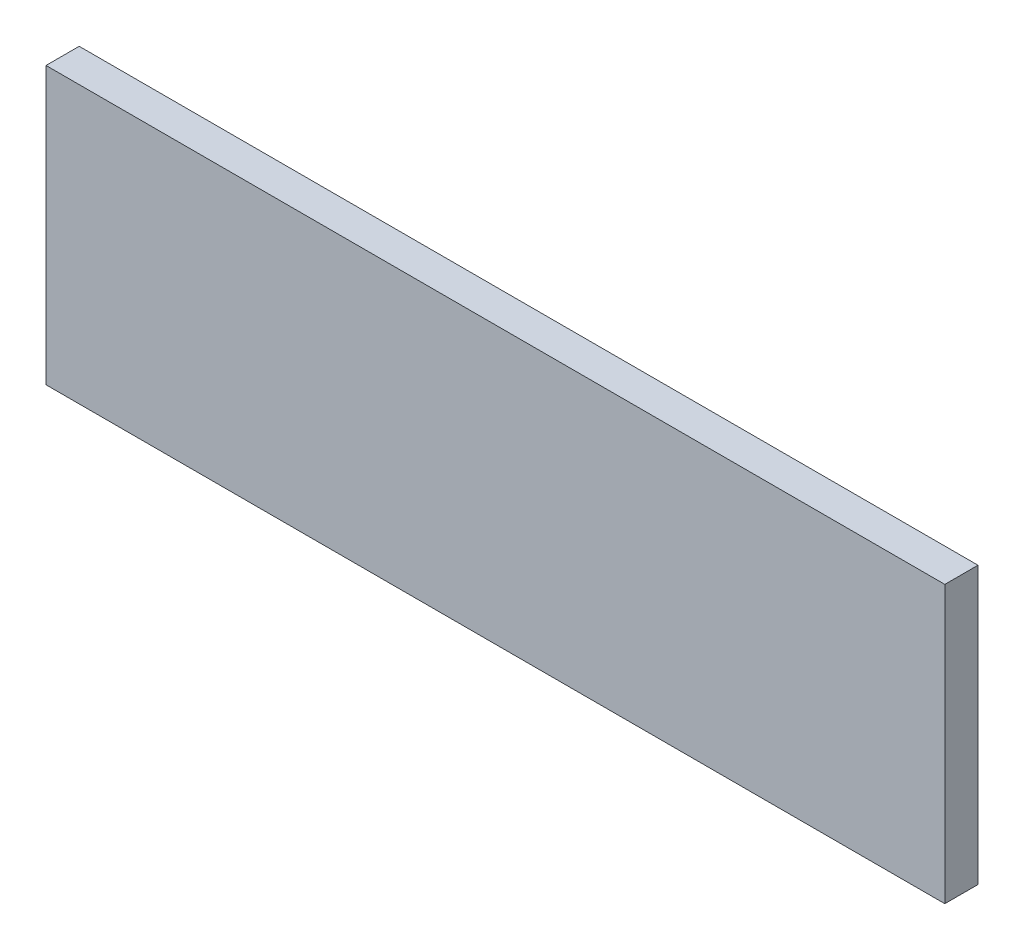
ISO-10303-21;
HEADER;
FILE_DESCRIPTION(('STEP AP214'),'2;1');
FILE_NAME('part.step','',(''),(''),'','','');
FILE_SCHEMA(('AUTOMOTIVE_DESIGN { 1 0 10303 214 1 1 1 1 }'));
ENDSEC;
DATA;
#1=APPLICATION_CONTEXT('core data for automotive mechanical design processes');
#2=APPLICATION_PROTOCOL_DEFINITION('international standard','automotive_design',2000,#1);
#3=PRODUCT_CONTEXT('',#1,'mechanical');
#4=PRODUCT('Part','Part','',(#3));
#5=PRODUCT_RELATED_PRODUCT_CATEGORY('part','',(#4));
#6=PRODUCT_DEFINITION_FORMATION('','',#4);
#7=PRODUCT_DEFINITION_CONTEXT('part definition',#1,'design');
#8=PRODUCT_DEFINITION('design','',#6,#7);
#9=PRODUCT_DEFINITION_SHAPE('','',#8);
#10=(LENGTH_UNIT() NAMED_UNIT(*) SI_UNIT(.MILLI.,.METRE.));
#11=(NAMED_UNIT(*) PLANE_ANGLE_UNIT() SI_UNIT($,.RADIAN.));
#12=(NAMED_UNIT(*) SI_UNIT($,.STERADIAN.) SOLID_ANGLE_UNIT());
#13=UNCERTAINTY_MEASURE_WITH_UNIT(LENGTH_MEASURE(1.E-05),#10,'distance_accuracy_value','');
#14=(GEOMETRIC_REPRESENTATION_CONTEXT(3) GLOBAL_UNCERTAINTY_ASSIGNED_CONTEXT((#13)) GLOBAL_UNIT_ASSIGNED_CONTEXT((#10,
#11,#12)) REPRESENTATION_CONTEXT('',''));
#15=CARTESIAN_POINT('',(0.,0.,0.));
#16=DIRECTION('',(0.,0.,1.));
#17=DIRECTION('',(1.,0.,0.));
#18=AXIS2_PLACEMENT_3D('',#15,#16,#17);
#19=CARTESIAN_POINT('',(0.,0.,12.));
#20=DIRECTION('',(1.,0.,0.));
#21=DIRECTION('',(0.,1.,0.));
#22=AXIS2_PLACEMENT_3D('',#19,#20,#21);
#23=PLANE('',#22);
#24=DIRECTION('',(0.,-1.,0.));
#25=VECTOR('',#24,1.);
#26=CARTESIAN_POINT('',(0.,0.,0.));
#27=LINE('',#26,#25);
#28=CARTESIAN_POINT('',(0.,0.,0.));
#29=VERTEX_POINT('',#28);
#30=CARTESIAN_POINT('',(0.,-100.,0.));
#31=VERTEX_POINT('',#30);
#32=EDGE_CURVE('E75',#29,#31,#27,.T.);
#33=ORIENTED_EDGE('',*,*,#32,.T.);
#34=DIRECTION('',(0.,0.,-1.));
#35=VECTOR('',#34,1.);
#36=CARTESIAN_POINT('',(0.,-100.,12.));
#37=LINE('',#36,#35);
#38=CARTESIAN_POINT('',(0.,-100.,12.));
#39=VERTEX_POINT('',#38);
#40=EDGE_CURVE('E11',#39,#31,#37,.T.);
#41=ORIENTED_EDGE('',*,*,#40,.F.);
#42=DIRECTION('',(0.,-1.,0.));
#43=VECTOR('',#42,1.);
#44=CARTESIAN_POINT('',(0.,0.,12.));
#45=LINE('',#44,#43);
#46=CARTESIAN_POINT('',(0.,0.,12.));
#47=VERTEX_POINT('',#46);
#48=EDGE_CURVE('E93',#47,#39,#45,.T.);
#49=ORIENTED_EDGE('',*,*,#48,.F.);
#50=DIRECTION('',(0.,0.,-1.));
#51=VECTOR('',#50,1.);
#52=CARTESIAN_POINT('',(0.,0.,12.));
#53=LINE('',#52,#51);
#54=EDGE_CURVE('E87',#47,#29,#53,.T.);
#55=ORIENTED_EDGE('',*,*,#54,.T.);
#56=EDGE_LOOP('',(#33,#41,#49,#55));
#57=FACE_BOUND('',#56,.T.);
#58=ADVANCED_FACE('F31',(#57),#23,.F.);
#59=CARTESIAN_POINT('',(0.,-100.,12.));
#60=DIRECTION('',(0.,1.,0.));
#61=DIRECTION('',(0.,0.,1.));
#62=AXIS2_PLACEMENT_3D('',#59,#60,#61);
#63=PLANE('',#62);
#64=DIRECTION('',(1.,0.,0.));
#65=VECTOR('',#64,1.);
#66=CARTESIAN_POINT('',(0.,-100.,0.));
#67=LINE('',#66,#65);
#68=CARTESIAN_POINT('',(325.,-100.,0.));
#69=VERTEX_POINT('',#68);
#70=EDGE_CURVE('E71',#31,#69,#67,.T.);
#71=ORIENTED_EDGE('',*,*,#70,.T.);
#72=DIRECTION('',(0.,0.,-1.));
#73=VECTOR('',#72,1.);
#74=CARTESIAN_POINT('',(325.,-100.,12.));
#75=LINE('',#74,#73);
#76=CARTESIAN_POINT('',(325.,-100.,12.));
#77=VERTEX_POINT('',#76);
#78=EDGE_CURVE('E38',#77,#69,#75,.T.);
#79=ORIENTED_EDGE('',*,*,#78,.F.);
#80=DIRECTION('',(1.,0.,0.));
#81=VECTOR('',#80,1.);
#82=CARTESIAN_POINT('',(0.,-100.,12.));
#83=LINE('',#82,#81);
#84=EDGE_CURVE('E83',#39,#77,#83,.T.);
#85=ORIENTED_EDGE('',*,*,#84,.F.);
#86=ORIENTED_EDGE('',*,*,#40,.T.);
#87=EDGE_LOOP('',(#71,#79,#85,#86));
#88=FACE_BOUND('',#87,.T.);
#89=ADVANCED_FACE('F82',(#88),#63,.F.);
#90=CARTESIAN_POINT('',(325.,0.,12.));
#91=DIRECTION('',(-1.,0.,0.));
#92=DIRECTION('',(0.,0.,1.));
#93=AXIS2_PLACEMENT_3D('',#90,#91,#92);
#94=PLANE('',#93);
#95=DIRECTION('',(0.,1.,0.));
#96=VECTOR('',#95,1.);
#97=CARTESIAN_POINT('',(325.,0.,0.));
#98=LINE('',#97,#96);
#99=CARTESIAN_POINT('',(325.,0.,0.));
#100=VERTEX_POINT('',#99);
#101=EDGE_CURVE('E76',#69,#100,#98,.T.);
#102=ORIENTED_EDGE('',*,*,#101,.T.);
#103=DIRECTION('',(0.,0.,-1.));
#104=VECTOR('',#103,1.);
#105=CARTESIAN_POINT('',(325.,0.,12.));
#106=LINE('',#105,#104);
#107=CARTESIAN_POINT('',(325.,0.,12.));
#108=VERTEX_POINT('',#107);
#109=EDGE_CURVE('E99',#108,#100,#106,.T.);
#110=ORIENTED_EDGE('',*,*,#109,.F.);
#111=DIRECTION('',(0.,1.,0.));
#112=VECTOR('',#111,1.);
#113=CARTESIAN_POINT('',(325.,0.,12.));
#114=LINE('',#113,#112);
#115=EDGE_CURVE('E50',#77,#108,#114,.T.);
#116=ORIENTED_EDGE('',*,*,#115,.F.);
#117=ORIENTED_EDGE('',*,*,#78,.T.);
#118=EDGE_LOOP('',(#102,#110,#116,#117));
#119=FACE_BOUND('',#118,.T.);
#120=ADVANCED_FACE('F102',(#119),#94,.F.);
#121=CARTESIAN_POINT('',(0.,0.,12.));
#122=DIRECTION('',(0.,-1.,0.));
#123=DIRECTION('',(0.,0.,-1.));
#124=AXIS2_PLACEMENT_3D('',#121,#122,#123);
#125=PLANE('',#124);
#126=DIRECTION('',(-1.,0.,0.));
#127=VECTOR('',#126,1.);
#128=CARTESIAN_POINT('',(0.,0.,0.));
#129=LINE('',#128,#127);
#130=EDGE_CURVE('E91',#100,#29,#129,.T.);
#131=ORIENTED_EDGE('',*,*,#130,.T.);
#132=ORIENTED_EDGE('',*,*,#54,.F.);
#133=DIRECTION('',(-1.,0.,0.));
#134=VECTOR('',#133,1.);
#135=CARTESIAN_POINT('',(0.,0.,12.));
#136=LINE('',#135,#134);
#137=EDGE_CURVE('E45',#108,#47,#136,.T.);
#138=ORIENTED_EDGE('',*,*,#137,.F.);
#139=ORIENTED_EDGE('',*,*,#109,.T.);
#140=EDGE_LOOP('',(#131,#132,#138,#139));
#141=FACE_BOUND('',#140,.T.);
#142=ADVANCED_FACE('F104',(#141),#125,.F.);
#143=CARTESIAN_POINT('',(0.,-100.,12.));
#144=DIRECTION('',(0.,0.,1.));
#145=DIRECTION('',(1.,0.,0.));
#146=AXIS2_PLACEMENT_3D('',#143,#144,#145);
#147=PLANE('',#146);
#148=ORIENTED_EDGE('',*,*,#48,.T.);
#149=ORIENTED_EDGE('',*,*,#84,.T.);
#150=ORIENTED_EDGE('',*,*,#115,.T.);
#151=ORIENTED_EDGE('',*,*,#137,.T.);
#152=EDGE_LOOP('',(#148,#149,#150,#151));
#153=FACE_BOUND('',#152,.T.);
#154=ADVANCED_FACE('F105',(#153),#147,.T.);
#155=CARTESIAN_POINT('',(0.,-100.,0.));
#156=DIRECTION('',(0.,0.,1.));
#157=DIRECTION('',(1.,0.,0.));
#158=AXIS2_PLACEMENT_3D('',#155,#156,#157);
#159=PLANE('',#158);
#160=ORIENTED_EDGE('',*,*,#32,.F.);
#161=ORIENTED_EDGE('',*,*,#130,.F.);
#162=ORIENTED_EDGE('',*,*,#101,.F.);
#163=ORIENTED_EDGE('',*,*,#70,.F.);
#164=EDGE_LOOP('',(#160,#161,#162,#163));
#165=FACE_BOUND('',#164,.T.);
#166=ADVANCED_FACE('F72',(#165),#159,.F.);
#167=CLOSED_SHELL('',(#58,#89,#120,#142,#154,#166));
#168=MANIFOLD_SOLID_BREP('B2',#167);
#169=ADVANCED_BREP_SHAPE_REPRESENTATION('',(#18,#168),#14);
#170=SHAPE_DEFINITION_REPRESENTATION(#9,#169);
ENDSEC;
END-ISO-10303-21;
